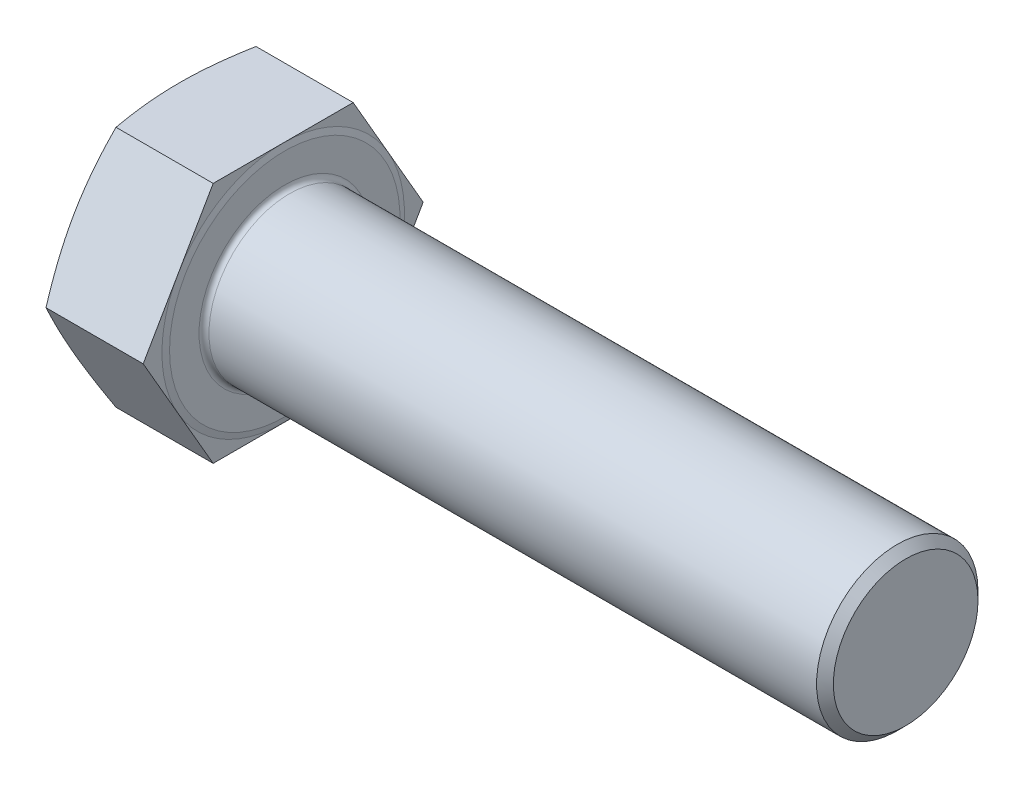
ISO-10303-21;
HEADER;
FILE_DESCRIPTION(('STEP AP214'),'2;1');
FILE_NAME('part.step','',(''),(''),'','','');
FILE_SCHEMA(('AUTOMOTIVE_DESIGN { 1 0 10303 214 1 1 1 1 }'));
ENDSEC;
DATA;
#1=APPLICATION_CONTEXT('core data for automotive mechanical design processes');
#2=APPLICATION_PROTOCOL_DEFINITION('international standard','automotive_design',2000,#1);
#3=PRODUCT_CONTEXT('',#1,'mechanical');
#4=PRODUCT('Part','Part','',(#3));
#5=PRODUCT_RELATED_PRODUCT_CATEGORY('part','',(#4));
#6=PRODUCT_DEFINITION_FORMATION('','',#4);
#7=PRODUCT_DEFINITION_CONTEXT('part definition',#1,'design');
#8=PRODUCT_DEFINITION('design','',#6,#7);
#9=PRODUCT_DEFINITION_SHAPE('','',#8);
#10=(LENGTH_UNIT() NAMED_UNIT(*) SI_UNIT(.MILLI.,.METRE.));
#11=(NAMED_UNIT(*) PLANE_ANGLE_UNIT() SI_UNIT($,.RADIAN.));
#12=(NAMED_UNIT(*) SI_UNIT($,.STERADIAN.) SOLID_ANGLE_UNIT());
#13=UNCERTAINTY_MEASURE_WITH_UNIT(LENGTH_MEASURE(1.E-05),#10,'distance_accuracy_value','');
#14=(GEOMETRIC_REPRESENTATION_CONTEXT(3) GLOBAL_UNCERTAINTY_ASSIGNED_CONTEXT((#13)) GLOBAL_UNIT_ASSIGNED_CONTEXT((#10,
#11,#12)) REPRESENTATION_CONTEXT('',''));
#15=CARTESIAN_POINT('',(0.,0.,0.));
#16=DIRECTION('',(0.,0.,1.));
#17=DIRECTION('',(1.,0.,0.));
#18=AXIS2_PLACEMENT_3D('',#15,#16,#17);
#19=CARTESIAN_POINT('',(34.,0.,0.));
#20=DIRECTION('',(1.,0.,0.));
#21=DIRECTION('',(0.,0.,-1.));
#22=AXIS2_PLACEMENT_3D('',#19,#20,#21);
#23=PLANE('',#22);
#24=CARTESIAN_POINT('',(34.,0.,0.));
#25=DIRECTION('',(1.,0.,0.));
#26=DIRECTION('',(0.,0.,-1.));
#27=AXIS2_PLACEMENT_3D('',#24,#25,#26);
#28=CIRCLE('',#27,27.6);
#29=CARTESIAN_POINT('',(34.,0.,-27.6));
#30=VERTEX_POINT('',#29);
#31=EDGE_CURVE('E188',#30,#30,#28,.F.);
#32=ORIENTED_EDGE('',*,*,#31,.T.);
#33=EDGE_LOOP('',(#32));
#34=FACE_BOUND('',#33,.T.);
#35=CARTESIAN_POINT('',(34.,0.,0.));
#36=DIRECTION('',(-1.,0.,0.));
#37=DIRECTION('',(0.,0.,1.));
#38=AXIS2_PLACEMENT_3D('',#35,#36,#37);
#39=CIRCLE('',#38,37.1);
#40=CARTESIAN_POINT('',(34.,0.,37.1));
#41=VERTEX_POINT('',#40);
#42=EDGE_CURVE('E139',#41,#41,#39,.T.);
#43=ORIENTED_EDGE('',*,*,#42,.F.);
#44=EDGE_LOOP('',(#43));
#45=FACE_BOUND('',#44,.T.);
#46=ADVANCED_FACE('F33',(#34,#45),#23,.T.);
#47=CARTESIAN_POINT('',(33.5,0.,-45.0910560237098));
#48=DIRECTION('',(1.,0.,0.));
#49=DIRECTION('',(0.,0.,-1.));
#50=AXIS2_PLACEMENT_3D('',#47,#48,#49);
#51=PLANE('',#50);
#52=DIRECTION('',(0.,-0.866025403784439,0.5));
#53=VECTOR('',#52,1.);
#54=CARTESIAN_POINT('',(33.5,39.05,22.5455280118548));
#55=LINE('',#54,#53);
#56=CARTESIAN_POINT('',(33.5,39.05,22.5455280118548));
#57=VERTEX_POINT('',#56);
#58=CARTESIAN_POINT('',(33.5,19.525,33.8182920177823));
#59=VERTEX_POINT('',#58);
#60=EDGE_CURVE('E138',#57,#59,#55,.T.);
#61=ORIENTED_EDGE('',*,*,#60,.T.);
#62=CARTESIAN_POINT('',(33.5,0.,0.));
#63=DIRECTION('',(-1.,0.,0.));
#64=DIRECTION('',(0.,0.,1.));
#65=AXIS2_PLACEMENT_3D('',#62,#63,#64);
#66=CIRCLE('',#65,39.05);
#67=CARTESIAN_POINT('',(33.5,39.05,0.));
#68=VERTEX_POINT('',#67);
#69=EDGE_CURVE('E49',#59,#68,#66,.T.);
#70=ORIENTED_EDGE('',*,*,#69,.T.);
#71=DIRECTION('',(0.,0.,1.));
#72=VECTOR('',#71,1.);
#73=CARTESIAN_POINT('',(33.5,39.05,-22.5455280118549));
#74=LINE('',#73,#72);
#75=EDGE_CURVE('E135',#68,#57,#74,.T.);
#76=ORIENTED_EDGE('',*,*,#75,.T.);
#77=EDGE_LOOP('',(#61,#70,#76));
#78=FACE_BOUND('',#77,.T.);
#79=ADVANCED_FACE('F134',(#78),#51,.T.);
#80=CARTESIAN_POINT('',(33.5,39.05,-22.5455280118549));
#81=VERTEX_POINT('',#80);
#82=EDGE_CURVE('E145',#81,#68,#74,.T.);
#83=ORIENTED_EDGE('',*,*,#82,.T.);
#84=CARTESIAN_POINT('',(33.5,19.525,-33.8182920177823));
#85=VERTEX_POINT('',#84);
#86=EDGE_CURVE('E122',#68,#85,#66,.T.);
#87=ORIENTED_EDGE('',*,*,#86,.T.);
#88=DIRECTION('',(0.,0.866025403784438,0.5));
#89=VECTOR('',#88,1.);
#90=CARTESIAN_POINT('',(33.5,0.,-45.0910560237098));
#91=LINE('',#90,#89);
#92=EDGE_CURVE('E151',#85,#81,#91,.T.);
#93=ORIENTED_EDGE('',*,*,#92,.T.);
#94=EDGE_LOOP('',(#83,#87,#93));
#95=FACE_BOUND('',#94,.T.);
#96=ADVANCED_FACE('F150',(#95),#51,.T.);
#97=CARTESIAN_POINT('',(33.5,0.,-45.0910560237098));
#98=VERTEX_POINT('',#97);
#99=EDGE_CURVE('E148',#98,#85,#91,.T.);
#100=ORIENTED_EDGE('',*,*,#99,.T.);
#101=CARTESIAN_POINT('',(33.5,-19.525,-33.8182920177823));
#102=VERTEX_POINT('',#101);
#103=EDGE_CURVE('E125',#85,#102,#66,.T.);
#104=ORIENTED_EDGE('',*,*,#103,.T.);
#105=DIRECTION('',(0.,0.866025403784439,-0.5));
#106=VECTOR('',#105,1.);
#107=CARTESIAN_POINT('',(33.5,-39.05,-22.5455280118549));
#108=LINE('',#107,#106);
#109=EDGE_CURVE('E306',#102,#98,#108,.T.);
#110=ORIENTED_EDGE('',*,*,#109,.T.);
#111=EDGE_LOOP('',(#100,#104,#110));
#112=FACE_BOUND('',#111,.T.);
#113=ADVANCED_FACE('F337',(#112),#51,.T.);
#114=CARTESIAN_POINT('',(33.5,-39.05,-22.5455280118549));
#115=VERTEX_POINT('',#114);
#116=EDGE_CURVE('E304',#115,#102,#108,.T.);
#117=ORIENTED_EDGE('',*,*,#116,.T.);
#118=CARTESIAN_POINT('',(33.5,-39.05,0.));
#119=VERTEX_POINT('',#118);
#120=EDGE_CURVE('E338',#102,#119,#66,.T.);
#121=ORIENTED_EDGE('',*,*,#120,.T.);
#122=DIRECTION('',(0.,0.,-1.));
#123=VECTOR('',#122,1.);
#124=CARTESIAN_POINT('',(33.5,-39.05,22.5455280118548));
#125=LINE('',#124,#123);
#126=EDGE_CURVE('E162',#119,#115,#125,.T.);
#127=ORIENTED_EDGE('',*,*,#126,.T.);
#128=EDGE_LOOP('',(#117,#121,#127));
#129=FACE_BOUND('',#128,.T.);
#130=ADVANCED_FACE('F352',(#129),#51,.T.);
#131=CARTESIAN_POINT('',(33.5,-39.05,22.5455280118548));
#132=VERTEX_POINT('',#131);
#133=EDGE_CURVE('E163',#132,#119,#125,.T.);
#134=ORIENTED_EDGE('',*,*,#133,.T.);
#135=CARTESIAN_POINT('',(33.5,-19.525,33.8182920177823));
#136=VERTEX_POINT('',#135);
#137=EDGE_CURVE('E339',#119,#136,#66,.T.);
#138=ORIENTED_EDGE('',*,*,#137,.T.);
#139=DIRECTION('',(0.,-0.866025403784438,-0.5));
#140=VECTOR('',#139,1.);
#141=CARTESIAN_POINT('',(33.5,0.,45.0910560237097));
#142=LINE('',#141,#140);
#143=EDGE_CURVE('E158',#136,#132,#142,.T.);
#144=ORIENTED_EDGE('',*,*,#143,.T.);
#145=EDGE_LOOP('',(#134,#138,#144));
#146=FACE_BOUND('',#145,.T.);
#147=ADVANCED_FACE('F347',(#146),#51,.T.);
#148=CARTESIAN_POINT('',(33.5,0.,45.0910560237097));
#149=VERTEX_POINT('',#148);
#150=EDGE_CURVE('E159',#149,#136,#142,.T.);
#151=ORIENTED_EDGE('',*,*,#150,.T.);
#152=EDGE_CURVE('E140',#136,#59,#66,.T.);
#153=ORIENTED_EDGE('',*,*,#152,.T.);
#154=EDGE_CURVE('E153',#59,#149,#55,.T.);
#155=ORIENTED_EDGE('',*,*,#154,.T.);
#156=EDGE_LOOP('',(#151,#153,#155));
#157=FACE_BOUND('',#156,.T.);
#158=ADVANCED_FACE('F213',(#157),#51,.T.);
#159=CARTESIAN_POINT('',(33.5,-39.05,-22.5455280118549));
#160=DIRECTION('',(0.,0.5,0.866025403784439));
#161=DIRECTION('',(0.,-0.866025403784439,0.5));
#162=AXIS2_PLACEMENT_3D('',#159,#160,#161);
#163=PLANE('',#162);
#164=CARTESIAN_POINT('',(2.19880660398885,0.000200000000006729,-45.0911714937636));
#165=CARTESIAN_POINT('',(2.02887897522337,-0.808464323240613,-44.6242889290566));
#166=CARTESIAN_POINT('',(1.86659855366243,-1.61836242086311,-44.1566940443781));
#167=CARTESIAN_POINT('',(1.5590027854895,-3.24064593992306,-43.220068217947));
#168=CARTESIAN_POINT('',(1.41368905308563,-4.05303159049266,-42.7510371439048));
#169=CARTESIAN_POINT('',(1.14162647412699,-5.68077724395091,-41.8112577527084));
#170=CARTESIAN_POINT('',(1.01489188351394,-6.49613904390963,-41.3405083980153));
#171=CARTESIAN_POINT('',(0.781802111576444,-8.12903082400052,-40.3977578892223));
#172=CARTESIAN_POINT('',(0.675446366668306,-8.94656074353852,-39.9257567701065));
#173=CARTESIAN_POINT('',(0.485579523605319,-10.5758302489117,-38.9850975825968));
#174=CARTESIAN_POINT('',(0.401862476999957,-11.3875517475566,-38.5164499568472));
#175=CARTESIAN_POINT('',(0.257292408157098,-13.0125329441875,-37.5782666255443));
#176=CARTESIAN_POINT('',(0.196439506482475,-13.8257926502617,-37.1087309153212));
#177=CARTESIAN_POINT('',(0.0986562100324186,-15.4530980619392,-36.1692056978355));
#178=CARTESIAN_POINT('',(0.0617170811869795,-16.2671433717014,-35.6992164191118));
#179=CARTESIAN_POINT('',(0.0123890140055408,-17.8957924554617,-34.7589154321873));
#180=CARTESIAN_POINT('',(0.,-18.7103962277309,-34.2886037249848));
#181=CARTESIAN_POINT('',(0.,-20.3396037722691,-33.3479803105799));
#182=CARTESIAN_POINT('',(0.0123890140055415,-21.1542075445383,-32.8776686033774));
#183=CARTESIAN_POINT('',(0.0617170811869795,-22.7828566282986,-31.9373676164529));
#184=CARTESIAN_POINT('',(0.0986562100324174,-23.5969019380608,-31.4673783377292));
#185=CARTESIAN_POINT('',(0.196439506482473,-25.2242073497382,-30.5278531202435));
#186=CARTESIAN_POINT('',(0.257292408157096,-26.0374670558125,-30.0583174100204));
#187=CARTESIAN_POINT('',(0.401862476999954,-27.6624482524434,-29.1201340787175));
#188=CARTESIAN_POINT('',(0.485579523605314,-28.4741697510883,-28.6514864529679));
#189=CARTESIAN_POINT('',(0.675446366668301,-30.1034392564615,-27.7108272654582));
#190=CARTESIAN_POINT('',(0.78180211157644,-30.9209691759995,-27.2388261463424));
#191=CARTESIAN_POINT('',(1.01489188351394,-32.5538609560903,-26.2960756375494));
#192=CARTESIAN_POINT('',(1.14162647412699,-33.3692227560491,-25.8253262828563));
#193=CARTESIAN_POINT('',(1.41368905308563,-34.9969684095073,-24.8855468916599));
#194=CARTESIAN_POINT('',(1.5590027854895,-35.8093540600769,-24.4165158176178));
#195=CARTESIAN_POINT('',(1.86659855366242,-37.4316375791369,-23.4798899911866));
#196=CARTESIAN_POINT('',(2.02887897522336,-38.2415356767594,-23.0122951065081));
#197=CARTESIAN_POINT('',(2.19880660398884,-39.0502,-22.5454125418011));
#198=B_SPLINE_CURVE_WITH_KNOTS('',3,(#164,#165,#166,#167,#168,#169,#170,#171,#172,#173,#174,
#175,#176,#177,#178,#179,#180,#181,#182,#183,#184,#185,#186,#187,#188,#189,#190,#191,#192,#193,
#194,#195,#196,#197),.UNSPECIFIED.,.F.,.F.,(4,2,2,2,2,2,2,2,2,2,2,2,2,2,2,2,4),(0.,
2.8473194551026,5.69490958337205,8.54467338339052,11.3943583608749,14.2171733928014,
17.040003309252,19.8618016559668,22.6835913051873,25.5053809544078,28.3271793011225,
31.1500092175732,33.9728242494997,36.822509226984,39.6722730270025,42.519863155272,
45.3671826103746),.UNSPECIFIED.);
#199=CARTESIAN_POINT('',(2.19876457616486,0.,-45.0910560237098));
#200=VERTEX_POINT('',#199);
#201=CARTESIAN_POINT('',(0.,-19.525,-33.8182920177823));
#202=VERTEX_POINT('',#201);
#203=EDGE_CURVE('E321',#200,#202,#198,.T.);
#204=ORIENTED_EDGE('',*,*,#203,.F.);
#205=DIRECTION('',(-1.,0.,0.));
#206=VECTOR('',#205,1.);
#207=CARTESIAN_POINT('',(33.5,0.,-45.0910560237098));
#208=LINE('',#207,#206);
#209=EDGE_CURVE('E178',#98,#200,#208,.T.);
#210=ORIENTED_EDGE('',*,*,#209,.F.);
#211=ORIENTED_EDGE('',*,*,#109,.F.);
#212=ORIENTED_EDGE('',*,*,#116,.F.);
#213=DIRECTION('',(-1.,0.,0.));
#214=VECTOR('',#213,1.);
#215=CARTESIAN_POINT('',(33.5,-39.05,-22.5455280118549));
#216=LINE('',#215,#214);
#217=CARTESIAN_POINT('',(2.19876457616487,-39.05,-22.545528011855));
#218=VERTEX_POINT('',#217);
#219=EDGE_CURVE('E166',#115,#218,#216,.T.);
#220=ORIENTED_EDGE('',*,*,#219,.T.);
#221=EDGE_CURVE('E246',#202,#218,#198,.T.);
#222=ORIENTED_EDGE('',*,*,#221,.F.);
#223=EDGE_LOOP('',(#204,#210,#211,#212,#220,#222));
#224=FACE_BOUND('',#223,.T.);
#225=ADVANCED_FACE('F35',(#224),#163,.F.);
#226=CARTESIAN_POINT('',(33.5,0.,-45.0910560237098));
#227=DIRECTION('',(0.,-0.5,0.866025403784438));
#228=DIRECTION('',(0.,-0.866025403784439,-0.5));
#229=AXIS2_PLACEMENT_3D('',#226,#227,#228);
#230=PLANE('',#229);
#231=CARTESIAN_POINT('',(2.19880660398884,39.0502,-22.5454125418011));
#232=CARTESIAN_POINT('',(2.02887897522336,38.2415356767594,-23.0122951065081));
#233=CARTESIAN_POINT('',(1.86659855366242,37.4316375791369,-23.4798899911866));
#234=CARTESIAN_POINT('',(1.5590027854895,35.8093540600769,-24.4165158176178));
#235=CARTESIAN_POINT('',(1.41368905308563,34.9969684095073,-24.8855468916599));
#236=CARTESIAN_POINT('',(1.14162647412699,33.3692227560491,-25.8253262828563));
#237=CARTESIAN_POINT('',(1.01489188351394,32.5538609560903,-26.2960756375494));
#238=CARTESIAN_POINT('',(0.781802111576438,30.9209691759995,-27.2388261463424));
#239=CARTESIAN_POINT('',(0.6754463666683,30.1034392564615,-27.7108272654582));
#240=CARTESIAN_POINT('',(0.485579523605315,28.4741697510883,-28.6514864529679));
#241=CARTESIAN_POINT('',(0.401862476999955,27.6624482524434,-29.1201340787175));
#242=CARTESIAN_POINT('',(0.257292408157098,26.0374670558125,-30.0583174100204));
#243=CARTESIAN_POINT('',(0.196439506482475,25.2242073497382,-30.5278531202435));
#244=CARTESIAN_POINT('',(0.0986562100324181,23.5969019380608,-31.4673783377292));
#245=CARTESIAN_POINT('',(0.061717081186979,22.7828566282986,-31.9373676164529));
#246=CARTESIAN_POINT('',(0.0123890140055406,21.1542075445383,-32.8776686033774));
#247=CARTESIAN_POINT('',(0.,20.3396037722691,-33.3479803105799));
#248=CARTESIAN_POINT('',(0.,18.7103962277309,-34.2886037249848));
#249=CARTESIAN_POINT('',(0.0123890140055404,17.8957924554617,-34.7589154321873));
#250=CARTESIAN_POINT('',(0.0617170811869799,16.2671433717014,-35.6992164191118));
#251=CARTESIAN_POINT('',(0.0986562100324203,15.4530980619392,-36.1692056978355));
#252=CARTESIAN_POINT('',(0.196439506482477,13.8257926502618,-37.1087309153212));
#253=CARTESIAN_POINT('',(0.257292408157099,13.0125329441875,-37.5782666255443));
#254=CARTESIAN_POINT('',(0.401862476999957,11.3875517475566,-38.5164499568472));
#255=CARTESIAN_POINT('',(0.485579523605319,10.5758302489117,-38.9850975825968));
#256=CARTESIAN_POINT('',(0.675446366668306,8.94656074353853,-39.9257567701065));
#257=CARTESIAN_POINT('',(0.781802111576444,8.12903082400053,-40.3977578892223));
#258=CARTESIAN_POINT('',(1.01489188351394,6.49613904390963,-41.3405083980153));
#259=CARTESIAN_POINT('',(1.14162647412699,5.68077724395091,-41.8112577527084));
#260=CARTESIAN_POINT('',(1.41368905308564,4.05303159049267,-42.7510371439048));
#261=CARTESIAN_POINT('',(1.5590027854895,3.24064593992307,-43.220068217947));
#262=CARTESIAN_POINT('',(1.86659855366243,1.61836242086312,-44.1566940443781));
#263=CARTESIAN_POINT('',(2.02887897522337,0.808464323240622,-44.6242889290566));
#264=CARTESIAN_POINT('',(2.19880660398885,-0.000199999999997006,-45.0911714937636));
#265=B_SPLINE_CURVE_WITH_KNOTS('',3,(#231,#232,#233,#234,#235,#236,#237,#238,#239,#240,#241,
#242,#243,#244,#245,#246,#247,#248,#249,#250,#251,#252,#253,#254,#255,#256,#257,#258,#259,#260,
#261,#262,#263,#264),.UNSPECIFIED.,.F.,.F.,(4,2,2,2,2,2,2,2,2,2,2,2,2,2,2,2,4),(0.,
2.8473194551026,5.69490958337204,8.54467338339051,11.3943583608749,14.2171733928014,
17.040003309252,19.8618016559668,22.6835913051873,25.5053809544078,28.3271793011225,
31.1500092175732,33.9728242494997,36.822509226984,39.6722730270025,42.519863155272,
45.3671826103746),.UNSPECIFIED.);
#266=CARTESIAN_POINT('',(2.19876457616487,39.05,-22.545528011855));
#267=VERTEX_POINT('',#266);
#268=CARTESIAN_POINT('',(0.,19.525,-33.8182920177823));
#269=VERTEX_POINT('',#268);
#270=EDGE_CURVE('E261',#267,#269,#265,.T.);
#271=ORIENTED_EDGE('',*,*,#270,.F.);
#272=DIRECTION('',(-1.,0.,0.));
#273=VECTOR('',#272,1.);
#274=CARTESIAN_POINT('',(33.5,39.05,-22.5455280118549));
#275=LINE('',#274,#273);
#276=EDGE_CURVE('E176',#81,#267,#275,.T.);
#277=ORIENTED_EDGE('',*,*,#276,.F.);
#278=ORIENTED_EDGE('',*,*,#92,.F.);
#279=ORIENTED_EDGE('',*,*,#99,.F.);
#280=ORIENTED_EDGE('',*,*,#209,.T.);
#281=EDGE_CURVE('E257',#269,#200,#265,.T.);
#282=ORIENTED_EDGE('',*,*,#281,.F.);
#283=EDGE_LOOP('',(#271,#277,#278,#279,#280,#282));
#284=FACE_BOUND('',#283,.T.);
#285=ADVANCED_FACE('F267',(#284),#230,.F.);
#286=CARTESIAN_POINT('',(33.5,39.05,-22.5455280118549));
#287=DIRECTION('',(0.,-1.,0.));
#288=DIRECTION('',(0.,0.,-1.));
#289=AXIS2_PLACEMENT_3D('',#286,#287,#288);
#290=PLANE('',#289);
#291=CARTESIAN_POINT('',(11.7493259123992,39.05,-59.6926306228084));
#292=CARTESIAN_POINT('',(11.4802734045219,39.05,-58.8092623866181));
#293=CARTESIAN_POINT('',(11.2128440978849,39.05,-57.9253982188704));
#294=CARTESIAN_POINT('',(10.6816039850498,39.05,-56.1565777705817));
#295=CARTESIAN_POINT('',(10.4177931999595,39.05,-55.271621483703));
#296=CARTESIAN_POINT('',(9.89414501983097,39.05,-53.5004580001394));
#297=CARTESIAN_POINT('',(9.63430793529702,39.05,-52.614250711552));
#298=CARTESIAN_POINT('',(9.11906909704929,39.05,-50.8405500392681));
#299=CARTESIAN_POINT('',(8.86366733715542,39.05,-49.9530566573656));
#300=CARTESIAN_POINT('',(8.10388292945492,39.05,-47.2851582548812));
#301=CARTESIAN_POINT('',(7.60690041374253,39.05,-45.5026344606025));
#302=CARTESIAN_POINT('',(6.63738312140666,39.05,-41.9309626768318));
#303=CARTESIAN_POINT('',(6.16484790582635,39.05,-40.1418148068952));
#304=CARTESIAN_POINT('',(5.25593806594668,39.05,-36.5778026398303));
#305=CARTESIAN_POINT('',(4.81918943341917,39.05,-34.8030342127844));
#306=CARTESIAN_POINT('',(3.98287501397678,39.05,-31.2446675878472));
#307=CARTESIAN_POINT('',(3.58330985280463,39.05,-29.4610692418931));
#308=CARTESIAN_POINT('',(2.83067996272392,39.05,-25.8846372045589));
#309=CARTESIAN_POINT('',(2.4775993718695,39.05,-24.0918068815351));
#310=CARTESIAN_POINT('',(1.82868609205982,39.05,-20.4957550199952));
#311=CARTESIAN_POINT('',(1.53285148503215,39.05,-18.6925338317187));
#312=CARTESIAN_POINT('',(1.03975259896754,39.05,-15.2786715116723));
#313=CARTESIAN_POINT('',(0.835155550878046,39.05,-13.6691062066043));
#314=CARTESIAN_POINT('',(0.575376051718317,39.05,-11.2497405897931));
#315=CARTESIAN_POINT('',(0.496634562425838,39.05,-10.4424344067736));
#316=CARTESIAN_POINT('',(0.355742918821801,39.05,-8.82638304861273));
#317=CARTESIAN_POINT('',(0.293592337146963,39.05,-8.01763791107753));
#318=CARTESIAN_POINT('',(0.186685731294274,39.05,-6.39955399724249));
#319=CARTESIAN_POINT('',(0.141917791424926,39.05,-5.59021600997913));
#320=CARTESIAN_POINT('',(0.0702941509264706,39.05,-3.9707445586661));
#321=CARTESIAN_POINT('',(0.0434384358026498,39.05,-3.16061109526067));
#322=CARTESIAN_POINT('',(0.00800035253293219,39.05,-1.53994595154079));
#323=CARTESIAN_POINT('',(-0.000582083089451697,39.05,-0.729414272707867));
#324=CARTESIAN_POINT('',(0.000643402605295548,39.05,0.89163530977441));
#325=CARTESIAN_POINT('',(0.0104513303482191,39.05,1.70215321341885));
#326=CARTESIAN_POINT('',(0.0484197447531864,39.05,3.32686781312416));
#327=CARTESIAN_POINT('',(0.0766729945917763,39.05,4.14106233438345));
#328=CARTESIAN_POINT('',(0.151238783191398,39.05,5.7686200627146));
#329=CARTESIAN_POINT('',(0.197551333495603,39.05,6.58198326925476));
#330=CARTESIAN_POINT('',(0.307633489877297,39.05,8.207525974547));
#331=CARTESIAN_POINT('',(0.371403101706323,39.05,9.01970547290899));
#332=CARTESIAN_POINT('',(0.515609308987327,39.05,10.6425901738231));
#333=CARTESIAN_POINT('',(0.596046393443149,39.05,11.4532953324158));
#334=CARTESIAN_POINT('',(0.86114202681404,39.05,13.8841730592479));
#335=CARTESIAN_POINT('',(1.06949487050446,39.05,15.5018176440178));
#336=CARTESIAN_POINT('',(1.42310454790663,39.05,17.9220965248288));
#337=CARTESIAN_POINT('',(1.54782354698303,39.05,18.7278379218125));
#338=CARTESIAN_POINT('',(1.80988051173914,39.05,20.3372790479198));
#339=CARTESIAN_POINT('',(1.94721856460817,39.05,21.1409787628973));
#340=CARTESIAN_POINT('',(2.39170088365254,39.05,23.6338557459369));
#341=CARTESIAN_POINT('',(2.71869181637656,39.05,25.3195088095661));
#342=CARTESIAN_POINT('',(3.41475154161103,39.05,28.6821282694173));
#343=CARTESIAN_POINT('',(3.78382350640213,39.05,30.3590940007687));
#344=CARTESIAN_POINT('',(4.55630449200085,39.05,33.7055725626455));
#345=CARTESIAN_POINT('',(4.95972348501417,39.05,35.3750830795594));
#346=CARTESIAN_POINT('',(5.79433369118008,39.05,38.7070690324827));
#347=CARTESIAN_POINT('',(6.22552423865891,39.05,40.3695446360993));
#348=CARTESIAN_POINT('',(7.11105522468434,39.05,43.6905844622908));
#349=CARTESIAN_POINT('',(7.56542468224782,39.05,45.3491409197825));
#350=CARTESIAN_POINT('',(8.49264683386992,39.05,48.6610719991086));
#351=CARTESIAN_POINT('',(8.96549960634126,39.05,50.3144465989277));
#352=CARTESIAN_POINT('',(9.92630538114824,39.05,53.6164920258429));
#353=CARTESIAN_POINT('',(10.4142558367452,39.05,55.2651635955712));
#354=CARTESIAN_POINT('',(11.4027093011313,39.05,58.5587293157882));
#355=CARTESIAN_POINT('',(11.9032122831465,39.05,60.2036234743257));
#356=CARTESIAN_POINT('',(12.9090964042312,39.05,63.4720449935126));
#357=CARTESIAN_POINT('',(13.41436267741,39.05,65.0956077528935));
#358=CARTESIAN_POINT('',(14.4335020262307,39.05,68.3400271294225));
#359=CARTESIAN_POINT('',(14.9473751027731,39.05,69.9608837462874));
#360=CARTESIAN_POINT('',(15.9824354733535,39.05,73.2003398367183));
#361=CARTESIAN_POINT('',(16.5036231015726,39.05,74.8189392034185));
#362=CARTESIAN_POINT('',(17.5522174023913,39.05,78.0541225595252));
#363=CARTESIAN_POINT('',(18.079624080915,39.05,79.6707065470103));
#364=CARTESIAN_POINT('',(19.1377632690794,39.05,82.8959891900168));
#365=CARTESIAN_POINT('',(19.668475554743,39.05,84.5046944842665));
#366=CARTESIAN_POINT('',(20.7344797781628,39.05,87.7205873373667));
#367=CARTESIAN_POINT('',(21.2697717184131,39.05,89.3277748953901));
#368=CARTESIAN_POINT('',(22.3442876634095,39.05,92.5406881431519));
#369=CARTESIAN_POINT('',(22.8835113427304,39.05,94.1464139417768));
#370=CARTESIAN_POINT('',(23.9654478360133,39.05,97.3566854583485));
#371=CARTESIAN_POINT('',(24.5081606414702,39.05,98.9612311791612));
#372=CARTESIAN_POINT('',(25.052376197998,39.05,100.565265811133));
#373=B_SPLINE_CURVE_WITH_KNOTS('',3,(#291,#292,#293,#294,#295,#296,#297,#298,#299,#300,#301,
#302,#303,#304,#305,#306,#307,#308,#309,#310,#311,#312,#313,#314,#315,#316,#317,#318,#319,#320,
#321,#322,#323,#324,#325,#326,#327,#328,#329,#330,#331,#332,#333,#334,#335,#336,#337,#338,#339,
#340,#341,#342,#343,#344,#345,#346,#347,#348,#349,#350,#351,#352,#353,#354,#355,#356,#357,#358,
#359,#360,#361,#362,#363,#364,#365,#366,#367,#368,#369,#370,#371,#372),.UNSPECIFIED.,.F.,.F.,(4,
2,2,2,2,2,2,2,2,2,2,2,2,2,2,2,2,2,2,2,2,2,2,2,2,2,2,2,2,2,2,2,2,2,2,2,2,2,2,2,4),(0.,
2.77029982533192,5.54061580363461,8.31114715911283,11.0816746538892,16.6330543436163,
22.1843343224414,27.6671699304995,33.150097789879,38.6311498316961,44.1120181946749,
48.9783767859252,51.4116444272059,53.8448493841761,56.276383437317,58.7079155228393,
61.139438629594,63.5709625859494,66.0148100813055,68.4586591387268,70.9025090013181,
73.3464305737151,78.2381511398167,80.6840912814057,83.1300483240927,88.2805427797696,
93.4314257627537,98.5838093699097,103.736069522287,108.894946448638,114.053845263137,
119.211878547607,124.369900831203,129.470975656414,134.572051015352,139.673360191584,
144.774674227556,149.856624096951,154.938576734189,160.020113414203,165.101637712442),.UNSPECIFIED.);
#374=CARTESIAN_POINT('',(2.19876457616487,39.0500000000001,22.5455280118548));
#375=VERTEX_POINT('',#374);
#376=CARTESIAN_POINT('',(0.,39.05,0.));
#377=VERTEX_POINT('',#376);
#378=EDGE_CURVE('E57',#375,#377,#373,.F.);
#379=ORIENTED_EDGE('',*,*,#378,.F.);
#380=DIRECTION('',(-1.,0.,0.));
#381=VECTOR('',#380,1.);
#382=CARTESIAN_POINT('',(33.5,39.05,22.5455280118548));
#383=LINE('',#382,#381);
#384=EDGE_CURVE('E147',#57,#375,#383,.T.);
#385=ORIENTED_EDGE('',*,*,#384,.F.);
#386=ORIENTED_EDGE('',*,*,#75,.F.);
#387=ORIENTED_EDGE('',*,*,#82,.F.);
#388=ORIENTED_EDGE('',*,*,#276,.T.);
#389=EDGE_CURVE('E262',#377,#267,#373,.F.);
#390=ORIENTED_EDGE('',*,*,#389,.F.);
#391=EDGE_LOOP('',(#379,#385,#386,#387,#388,#390));
#392=FACE_BOUND('',#391,.T.);
#393=ADVANCED_FACE('F143',(#392),#290,.F.);
#394=CARTESIAN_POINT('',(33.5,39.05,22.5455280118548));
#395=DIRECTION('',(0.,-0.5,-0.866025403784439));
#396=DIRECTION('',(0.,0.866025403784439,-0.5));
#397=AXIS2_PLACEMENT_3D('',#394,#395,#396);
#398=PLANE('',#397);
#399=CARTESIAN_POINT('',(2.19880660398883,-0.000200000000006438,45.0911714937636));
#400=CARTESIAN_POINT('',(2.02887897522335,0.808464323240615,44.6242889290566));
#401=CARTESIAN_POINT('',(1.86659855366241,1.61836242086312,44.156694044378));
#402=CARTESIAN_POINT('',(1.55900278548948,3.24064593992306,43.2200682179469));
#403=CARTESIAN_POINT('',(1.41368905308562,4.05303159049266,42.7510371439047));
#404=CARTESIAN_POINT('',(1.14162647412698,5.68077724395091,41.8112577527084));
#405=CARTESIAN_POINT('',(1.01489188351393,6.49613904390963,41.3405083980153));
#406=CARTESIAN_POINT('',(0.781802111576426,8.12903082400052,40.3977578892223));
#407=CARTESIAN_POINT('',(0.675446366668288,8.94656074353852,39.9257567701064));
#408=CARTESIAN_POINT('',(0.485579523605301,10.5758302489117,38.9850975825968));
#409=CARTESIAN_POINT('',(0.401862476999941,11.3875517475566,38.5164499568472));
#410=CARTESIAN_POINT('',(0.257292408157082,13.0125329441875,37.5782666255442));
#411=CARTESIAN_POINT('',(0.196439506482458,13.8257926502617,37.1087309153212));
#412=CARTESIAN_POINT('',(0.0986562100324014,15.4530980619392,36.1692056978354));
#413=CARTESIAN_POINT('',(0.0617170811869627,16.2671433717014,35.6992164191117));
#414=CARTESIAN_POINT('',(0.0123890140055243,17.8957924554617,34.7589154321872));
#415=CARTESIAN_POINT('',(0.,18.7103962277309,34.2886037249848));
#416=CARTESIAN_POINT('',(0.,20.3396037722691,33.3479803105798));
#417=CARTESIAN_POINT('',(0.0123890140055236,21.1542075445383,32.8776686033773));
#418=CARTESIAN_POINT('',(0.0617170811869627,22.7828566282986,31.9373676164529));
#419=CARTESIAN_POINT('',(0.0986562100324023,23.5969019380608,31.4673783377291));
#420=CARTESIAN_POINT('',(0.196439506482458,25.2242073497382,30.5278531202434));
#421=CARTESIAN_POINT('',(0.25729240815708,26.0374670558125,30.0583174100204));
#422=CARTESIAN_POINT('',(0.401862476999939,27.6624482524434,29.1201340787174));
#423=CARTESIAN_POINT('',(0.485579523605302,28.4741697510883,28.6514864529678));
#424=CARTESIAN_POINT('',(0.675446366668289,30.1034392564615,27.7108272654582));
#425=CARTESIAN_POINT('',(0.781802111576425,30.9209691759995,27.2388261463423));
#426=CARTESIAN_POINT('',(1.01489188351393,32.5538609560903,26.2960756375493));
#427=CARTESIAN_POINT('',(1.14162647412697,33.3692227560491,25.8253262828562));
#428=CARTESIAN_POINT('',(1.41368905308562,34.9969684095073,24.8855468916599));
#429=CARTESIAN_POINT('',(1.55900278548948,35.8093540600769,24.4165158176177));
#430=CARTESIAN_POINT('',(1.86659855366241,37.4316375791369,23.4798899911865));
#431=CARTESIAN_POINT('',(2.02887897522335,38.2415356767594,23.012295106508));
#432=CARTESIAN_POINT('',(2.19880660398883,39.0502,22.545412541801));
#433=B_SPLINE_CURVE_WITH_KNOTS('',3,(#399,#400,#401,#402,#403,#404,#405,#406,#407,#408,#409,
#410,#411,#412,#413,#414,#415,#416,#417,#418,#419,#420,#421,#422,#423,#424,#425,#426,#427,#428,
#429,#430,#431,#432),.UNSPECIFIED.,.F.,.F.,(4,2,2,2,2,2,2,2,2,2,2,2,2,2,2,2,4),(0.,
2.8473194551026,5.69490958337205,8.54467338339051,11.3943583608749,14.2171733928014,
17.040003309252,19.8618016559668,22.6835913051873,25.5053809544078,28.3271793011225,
31.1500092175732,33.9728242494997,36.822509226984,39.6722730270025,42.519863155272,
45.3671826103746),.UNSPECIFIED.);
#434=CARTESIAN_POINT('',(2.19876457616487,1.11022302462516E-13,45.0910560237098));
#435=VERTEX_POINT('',#434);
#436=CARTESIAN_POINT('',(0.,19.525,33.8182920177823));
#437=VERTEX_POINT('',#436);
#438=EDGE_CURVE('E251',#435,#437,#433,.T.);
#439=ORIENTED_EDGE('',*,*,#438,.F.);
#440=DIRECTION('',(-1.,0.,0.));
#441=VECTOR('',#440,1.);
#442=CARTESIAN_POINT('',(33.5,0.,45.0910560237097));
#443=LINE('',#442,#441);
#444=EDGE_CURVE('E172',#149,#435,#443,.T.);
#445=ORIENTED_EDGE('',*,*,#444,.F.);
#446=ORIENTED_EDGE('',*,*,#154,.F.);
#447=ORIENTED_EDGE('',*,*,#60,.F.);
#448=ORIENTED_EDGE('',*,*,#384,.T.);
#449=EDGE_CURVE('E312',#437,#375,#433,.T.);
#450=ORIENTED_EDGE('',*,*,#449,.F.);
#451=EDGE_LOOP('',(#439,#445,#446,#447,#448,#450));
#452=FACE_BOUND('',#451,.T.);
#453=ADVANCED_FACE('F273',(#452),#398,.F.);
#454=CARTESIAN_POINT('',(33.5,0.,45.0910560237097));
#455=DIRECTION('',(0.,0.5,-0.866025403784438));
#456=DIRECTION('',(0.,0.866025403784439,0.5));
#457=AXIS2_PLACEMENT_3D('',#454,#455,#456);
#458=PLANE('',#457);
#459=CARTESIAN_POINT('',(2.19880660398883,-39.0502,22.545412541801));
#460=CARTESIAN_POINT('',(2.02887897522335,-38.2415356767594,23.012295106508));
#461=CARTESIAN_POINT('',(1.86659855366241,-37.4316375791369,23.4798899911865));
#462=CARTESIAN_POINT('',(1.55900278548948,-35.8093540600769,24.4165158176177));
#463=CARTESIAN_POINT('',(1.41368905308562,-34.9969684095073,24.8855468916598));
#464=CARTESIAN_POINT('',(1.14162647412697,-33.3692227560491,25.8253262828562));
#465=CARTESIAN_POINT('',(1.01489188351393,-32.5538609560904,26.2960756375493));
#466=CARTESIAN_POINT('',(0.781802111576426,-30.9209691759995,27.2388261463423));
#467=CARTESIAN_POINT('',(0.675446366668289,-30.1034392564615,27.7108272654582));
#468=CARTESIAN_POINT('',(0.485579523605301,-28.4741697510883,28.6514864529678));
#469=CARTESIAN_POINT('',(0.40186247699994,-27.6624482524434,29.1201340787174));
#470=CARTESIAN_POINT('',(0.257292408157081,-26.0374670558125,30.0583174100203));
#471=CARTESIAN_POINT('',(0.196439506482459,-25.2242073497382,30.5278531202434));
#472=CARTESIAN_POINT('',(0.0986562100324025,-23.5969019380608,31.4673783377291));
#473=CARTESIAN_POINT('',(0.0617170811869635,-22.7828566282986,31.9373676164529));
#474=CARTESIAN_POINT('',(0.0123890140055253,-21.1542075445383,32.8776686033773));
#475=CARTESIAN_POINT('',(0.,-20.3396037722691,33.3479803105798));
#476=CARTESIAN_POINT('',(0.,-18.7103962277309,34.2886037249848));
#477=CARTESIAN_POINT('',(0.0123890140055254,-17.8957924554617,34.7589154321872));
#478=CARTESIAN_POINT('',(0.0617170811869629,-16.2671433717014,35.6992164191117));
#479=CARTESIAN_POINT('',(0.0986562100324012,-15.4530980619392,36.1692056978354));
#480=CARTESIAN_POINT('',(0.196439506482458,-13.8257926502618,37.1087309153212));
#481=CARTESIAN_POINT('',(0.257292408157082,-13.0125329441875,37.5782666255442));
#482=CARTESIAN_POINT('',(0.40186247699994,-11.3875517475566,38.5164499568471));
#483=CARTESIAN_POINT('',(0.4855795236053,-10.5758302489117,38.9850975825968));
#484=CARTESIAN_POINT('',(0.675446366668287,-8.94656074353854,39.9257567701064));
#485=CARTESIAN_POINT('',(0.781802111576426,-8.12903082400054,40.3977578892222));
#486=CARTESIAN_POINT('',(1.01489188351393,-6.49613904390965,41.3405083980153));
#487=CARTESIAN_POINT('',(1.14162647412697,-5.68077724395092,41.8112577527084));
#488=CARTESIAN_POINT('',(1.41368905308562,-4.05303159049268,42.7510371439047));
#489=CARTESIAN_POINT('',(1.55900278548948,-3.24064593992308,43.2200682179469));
#490=CARTESIAN_POINT('',(1.86659855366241,-1.61836242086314,44.156694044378));
#491=CARTESIAN_POINT('',(2.02887897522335,-0.808464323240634,44.6242889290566));
#492=CARTESIAN_POINT('',(2.19880660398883,0.000199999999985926,45.0911714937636));
#493=B_SPLINE_CURVE_WITH_KNOTS('',3,(#459,#460,#461,#462,#463,#464,#465,#466,#467,#468,#469,
#470,#471,#472,#473,#474,#475,#476,#477,#478,#479,#480,#481,#482,#483,#484,#485,#486,#487,#488,
#489,#490,#491,#492),.UNSPECIFIED.,.F.,.F.,(4,2,2,2,2,2,2,2,2,2,2,2,2,2,2,2,4),(0.,
2.8473194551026,5.69490958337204,8.54467338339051,11.3943583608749,14.2171733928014,
17.040003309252,19.8618016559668,22.6835913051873,25.5053809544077,28.3271793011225,
31.1500092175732,33.9728242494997,36.822509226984,39.6722730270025,42.5198631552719,
45.3671826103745),.UNSPECIFIED.);
#494=CARTESIAN_POINT('',(2.19876457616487,-39.05,22.545528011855));
#495=VERTEX_POINT('',#494);
#496=CARTESIAN_POINT('',(0.,-19.525,33.8182920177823));
#497=VERTEX_POINT('',#496);
#498=EDGE_CURVE('E239',#495,#497,#493,.T.);
#499=ORIENTED_EDGE('',*,*,#498,.F.);
#500=DIRECTION('',(-1.,0.,0.));
#501=VECTOR('',#500,1.);
#502=CARTESIAN_POINT('',(33.5,-39.05,22.5455280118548));
#503=LINE('',#502,#501);
#504=EDGE_CURVE('E169',#132,#495,#503,.T.);
#505=ORIENTED_EDGE('',*,*,#504,.F.);
#506=ORIENTED_EDGE('',*,*,#143,.F.);
#507=ORIENTED_EDGE('',*,*,#150,.F.);
#508=ORIENTED_EDGE('',*,*,#444,.T.);
#509=EDGE_CURVE('E317',#497,#435,#493,.T.);
#510=ORIENTED_EDGE('',*,*,#509,.F.);
#511=EDGE_LOOP('',(#499,#505,#506,#507,#508,#510));
#512=FACE_BOUND('',#511,.T.);
#513=ADVANCED_FACE('F276',(#512),#458,.F.);
#514=CARTESIAN_POINT('',(33.5,-39.05,22.5455280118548));
#515=DIRECTION('',(0.,1.,0.));
#516=DIRECTION('',(0.,0.,1.));
#517=AXIS2_PLACEMENT_3D('',#514,#515,#516);
#518=PLANE('',#517);
#519=CARTESIAN_POINT('',(11.7493259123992,-39.05,-59.6926306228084));
#520=CARTESIAN_POINT('',(11.4802734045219,-39.05,-58.8092623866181));
#521=CARTESIAN_POINT('',(11.2128440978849,-39.05,-57.9253982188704));
#522=CARTESIAN_POINT('',(10.6816039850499,-39.05,-56.1565777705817));
#523=CARTESIAN_POINT('',(10.4177931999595,-39.05,-55.271621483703));
#524=CARTESIAN_POINT('',(9.89414501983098,-39.05,-53.5004580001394));
#525=CARTESIAN_POINT('',(9.63430793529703,-39.05,-52.614250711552));
#526=CARTESIAN_POINT('',(9.11906909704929,-39.05,-50.8405500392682));
#527=CARTESIAN_POINT('',(8.86366733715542,-39.05,-49.9530566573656));
#528=CARTESIAN_POINT('',(8.10388292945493,-39.05,-47.2851582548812));
#529=CARTESIAN_POINT('',(7.60690041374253,-39.05,-45.5026344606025));
#530=CARTESIAN_POINT('',(6.63738312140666,-39.05,-41.9309626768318));
#531=CARTESIAN_POINT('',(6.16484790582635,-39.05,-40.1418148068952));
#532=CARTESIAN_POINT('',(5.25593806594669,-39.05,-36.5778026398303));
#533=CARTESIAN_POINT('',(4.81918943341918,-39.05,-34.8030342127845));
#534=CARTESIAN_POINT('',(3.98287501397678,-39.05,-31.2446675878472));
#535=CARTESIAN_POINT('',(3.58330985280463,-39.05,-29.4610692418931));
#536=CARTESIAN_POINT('',(2.83067996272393,-39.05,-25.8846372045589));
#537=CARTESIAN_POINT('',(2.4775993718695,-39.05,-24.0918068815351));
#538=CARTESIAN_POINT('',(1.82868609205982,-39.05,-20.4957550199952));
#539=CARTESIAN_POINT('',(1.53285148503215,-39.05,-18.6925338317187));
#540=CARTESIAN_POINT('',(1.03975259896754,-39.05,-15.2786715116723));
#541=CARTESIAN_POINT('',(0.835155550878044,-39.05,-13.6691062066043));
#542=CARTESIAN_POINT('',(0.575376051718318,-39.05,-11.2497405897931));
#543=CARTESIAN_POINT('',(0.496634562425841,-39.05,-10.4424344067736));
#544=CARTESIAN_POINT('',(0.355742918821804,-39.05,-8.82638304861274));
#545=CARTESIAN_POINT('',(0.293592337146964,-39.05,-8.01763791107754));
#546=CARTESIAN_POINT('',(0.186685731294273,-39.05,-6.3995539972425));
#547=CARTESIAN_POINT('',(0.141917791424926,-39.05,-5.59021600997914));
#548=CARTESIAN_POINT('',(0.0702941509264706,-39.05,-3.97074455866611));
#549=CARTESIAN_POINT('',(0.0434384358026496,-39.05,-3.16061109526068));
#550=CARTESIAN_POINT('',(0.00800035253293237,-39.05,-1.5399459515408));
#551=CARTESIAN_POINT('',(-0.000582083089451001,-39.05,-0.729414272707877));
#552=CARTESIAN_POINT('',(0.000643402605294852,-39.05,0.891635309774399));
#553=CARTESIAN_POINT('',(0.0104513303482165,-39.05,1.70215321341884));
#554=CARTESIAN_POINT('',(0.048419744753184,-39.05,3.32686781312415));
#555=CARTESIAN_POINT('',(0.0766729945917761,-39.05,4.14106233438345));
#556=CARTESIAN_POINT('',(0.151238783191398,-39.05,5.76862006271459));
#557=CARTESIAN_POINT('',(0.197551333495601,-39.05,6.58198326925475));
#558=CARTESIAN_POINT('',(0.307633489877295,-39.05,8.20752597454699));
#559=CARTESIAN_POINT('',(0.371403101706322,-39.05,9.01970547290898));
#560=CARTESIAN_POINT('',(0.515609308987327,-39.05,10.6425901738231));
#561=CARTESIAN_POINT('',(0.596046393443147,-39.05,11.4532953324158));
#562=CARTESIAN_POINT('',(0.861142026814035,-39.05,13.8841730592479));
#563=CARTESIAN_POINT('',(1.06949487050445,-39.05,15.5018176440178));
#564=CARTESIAN_POINT('',(1.42310454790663,-39.05,17.9220965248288));
#565=CARTESIAN_POINT('',(1.54782354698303,-39.05,18.7278379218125));
#566=CARTESIAN_POINT('',(1.80988051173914,-39.05,20.3372790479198));
#567=CARTESIAN_POINT('',(1.94721856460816,-39.05,21.1409787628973));
#568=CARTESIAN_POINT('',(2.39170088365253,-39.05,23.6338557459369));
#569=CARTESIAN_POINT('',(2.71869181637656,-39.05,25.3195088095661));
#570=CARTESIAN_POINT('',(3.41475154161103,-39.05,28.6821282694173));
#571=CARTESIAN_POINT('',(3.78382350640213,-39.05,30.3590940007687));
#572=CARTESIAN_POINT('',(4.55630449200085,-39.05,33.7055725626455));
#573=CARTESIAN_POINT('',(4.95972348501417,-39.05,35.3750830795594));
#574=CARTESIAN_POINT('',(5.79433369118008,-39.05,38.7070690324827));
#575=CARTESIAN_POINT('',(6.2255242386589,-39.05,40.3695446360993));
#576=CARTESIAN_POINT('',(7.11105522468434,-39.05,43.6905844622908));
#577=CARTESIAN_POINT('',(7.56542468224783,-39.05,45.3491409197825));
#578=CARTESIAN_POINT('',(8.49264683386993,-39.05,48.6610719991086));
#579=CARTESIAN_POINT('',(8.96549960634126,-39.05,50.3144465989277));
#580=CARTESIAN_POINT('',(9.92630538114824,-39.05,53.6164920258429));
#581=CARTESIAN_POINT('',(10.4142558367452,-39.05,55.2651635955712));
#582=CARTESIAN_POINT('',(11.4027093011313,-39.05,58.5587293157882));
#583=CARTESIAN_POINT('',(11.9032122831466,-39.05,60.2036234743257));
#584=CARTESIAN_POINT('',(12.9090964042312,-39.05,63.4720449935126));
#585=CARTESIAN_POINT('',(13.41436267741,-39.05,65.0956077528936));
#586=CARTESIAN_POINT('',(14.4335020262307,-39.05,68.3400271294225));
#587=CARTESIAN_POINT('',(14.9473751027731,-39.05,69.9608837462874));
#588=CARTESIAN_POINT('',(15.9824354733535,-39.05,73.2003398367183));
#589=CARTESIAN_POINT('',(16.5036231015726,-39.05,74.8189392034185));
#590=CARTESIAN_POINT('',(17.5522174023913,-39.05,78.0541225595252));
#591=CARTESIAN_POINT('',(18.079624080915,-39.05,79.6707065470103));
#592=CARTESIAN_POINT('',(19.1377632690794,-39.05,82.8959891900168));
#593=CARTESIAN_POINT('',(19.668475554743,-39.05,84.5046944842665));
#594=CARTESIAN_POINT('',(20.7344797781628,-39.05,87.7205873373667));
#595=CARTESIAN_POINT('',(21.2697717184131,-39.05,89.3277748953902));
#596=CARTESIAN_POINT('',(22.3442876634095,-39.05,92.5406881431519));
#597=CARTESIAN_POINT('',(22.8835113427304,-39.05,94.1464139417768));
#598=CARTESIAN_POINT('',(23.9654478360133,-39.05,97.3566854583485));
#599=CARTESIAN_POINT('',(24.5081606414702,-39.05,98.9612311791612));
#600=CARTESIAN_POINT('',(25.052376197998,-39.05,100.565265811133));
#601=B_SPLINE_CURVE_WITH_KNOTS('',3,(#519,#520,#521,#522,#523,#524,#525,#526,#527,#528,#529,
#530,#531,#532,#533,#534,#535,#536,#537,#538,#539,#540,#541,#542,#543,#544,#545,#546,#547,#548,
#549,#550,#551,#552,#553,#554,#555,#556,#557,#558,#559,#560,#561,#562,#563,#564,#565,#566,#567,
#568,#569,#570,#571,#572,#573,#574,#575,#576,#577,#578,#579,#580,#581,#582,#583,#584,#585,#586,
#587,#588,#589,#590,#591,#592,#593,#594,#595,#596,#597,#598,#599,#600),.UNSPECIFIED.,.F.,.F.,(4,
2,2,2,2,2,2,2,2,2,2,2,2,2,2,2,2,2,2,2,2,2,2,2,2,2,2,2,2,2,2,2,2,2,2,2,2,2,2,2,4),(0.,
2.77029982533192,5.54061580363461,8.31114715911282,11.0816746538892,16.6330543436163,
22.1843343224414,27.6671699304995,33.150097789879,38.6311498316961,44.1120181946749,
48.9783767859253,51.4116444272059,53.8448493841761,56.276383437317,58.7079155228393,
61.139438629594,63.5709625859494,66.0148100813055,68.4586591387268,70.9025090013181,
73.3464305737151,78.2381511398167,80.6840912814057,83.1300483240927,88.2805427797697,
93.4314257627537,98.5838093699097,103.736069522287,108.894946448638,114.053845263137,
119.211878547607,124.369900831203,129.470975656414,134.572051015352,139.673360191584,
144.774674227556,149.856624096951,154.938576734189,160.020113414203,165.101637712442),.UNSPECIFIED.);
#602=CARTESIAN_POINT('',(0.,-39.05,0.));
#603=VERTEX_POINT('',#602);
#604=EDGE_CURVE('E295',#218,#603,#601,.T.);
#605=ORIENTED_EDGE('',*,*,#604,.F.);
#606=ORIENTED_EDGE('',*,*,#219,.F.);
#607=ORIENTED_EDGE('',*,*,#126,.F.);
#608=ORIENTED_EDGE('',*,*,#133,.F.);
#609=ORIENTED_EDGE('',*,*,#504,.T.);
#610=EDGE_CURVE('E229',#603,#495,#601,.T.);
#611=ORIENTED_EDGE('',*,*,#610,.F.);
#612=EDGE_LOOP('',(#605,#606,#607,#608,#609,#611));
#613=FACE_BOUND('',#612,.T.);
#614=ADVANCED_FACE('F280',(#613),#518,.F.);
#615=CARTESIAN_POINT('',(0.,0.,0.));
#616=DIRECTION('',(1.,0.,0.));
#617=DIRECTION('',(0.,0.,-1.));
#618=AXIS2_PLACEMENT_3D('',#615,#616,#617);
#619=CONICAL_SURFACE('',#618,39.05,1.22173047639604);
#620=ORIENTED_EDGE('',*,*,#281,.T.);
#621=ORIENTED_EDGE('',*,*,#203,.T.);
#622=CARTESIAN_POINT('',(0.,0.,0.));
#623=DIRECTION('',(1.,0.,0.));
#624=DIRECTION('',(0.,0.,-1.));
#625=AXIS2_PLACEMENT_3D('',#622,#623,#624);
#626=CIRCLE('',#625,39.05);
#627=EDGE_CURVE('E181',#202,#269,#626,.T.);
#628=ORIENTED_EDGE('',*,*,#627,.T.);
#629=EDGE_LOOP('',(#620,#621,#628));
#630=FACE_BOUND('',#629,.T.);
#631=ADVANCED_FACE('F284',(#630),#619,.T.);
#632=ORIENTED_EDGE('',*,*,#221,.T.);
#633=ORIENTED_EDGE('',*,*,#604,.T.);
#634=EDGE_CURVE('E184',#603,#202,#626,.T.);
#635=ORIENTED_EDGE('',*,*,#634,.T.);
#636=EDGE_LOOP('',(#632,#633,#635));
#637=FACE_BOUND('',#636,.T.);
#638=ADVANCED_FACE('F289',(#637),#619,.T.);
#639=ORIENTED_EDGE('',*,*,#498,.T.);
#640=EDGE_CURVE('E330',#497,#603,#626,.T.);
#641=ORIENTED_EDGE('',*,*,#640,.T.);
#642=ORIENTED_EDGE('',*,*,#610,.T.);
#643=EDGE_LOOP('',(#639,#641,#642));
#644=FACE_BOUND('',#643,.T.);
#645=ADVANCED_FACE('F224',(#644),#619,.T.);
#646=ORIENTED_EDGE('',*,*,#438,.T.);
#647=EDGE_CURVE('E336',#437,#497,#626,.T.);
#648=ORIENTED_EDGE('',*,*,#647,.T.);
#649=ORIENTED_EDGE('',*,*,#509,.T.);
#650=EDGE_LOOP('',(#646,#648,#649));
#651=FACE_BOUND('',#650,.T.);
#652=ADVANCED_FACE('F223',(#651),#619,.T.);
#653=ORIENTED_EDGE('',*,*,#378,.T.);
#654=CARTESIAN_POINT('',(0.,0.,0.));
#655=DIRECTION('',(-1.,0.,0.));
#656=DIRECTION('',(0.,0.,1.));
#657=AXIS2_PLACEMENT_3D('',#654,#655,#656);
#658=CIRCLE('',#657,39.05);
#659=EDGE_CURVE('E335',#437,#377,#658,.T.);
#660=ORIENTED_EDGE('',*,*,#659,.F.);
#661=ORIENTED_EDGE('',*,*,#449,.T.);
#662=EDGE_LOOP('',(#653,#660,#661));
#663=FACE_BOUND('',#662,.T.);
#664=ADVANCED_FACE('F218',(#663),#619,.T.);
#665=ORIENTED_EDGE('',*,*,#389,.T.);
#666=ORIENTED_EDGE('',*,*,#270,.T.);
#667=EDGE_CURVE('E185',#269,#377,#626,.T.);
#668=ORIENTED_EDGE('',*,*,#667,.T.);
#669=EDGE_LOOP('',(#665,#666,#668));
#670=FACE_BOUND('',#669,.T.);
#671=ADVANCED_FACE('F222',(#670),#619,.T.);
#672=CARTESIAN_POINT('',(0.,0.,-45.0910560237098));
#673=DIRECTION('',(1.,0.,0.));
#674=DIRECTION('',(0.,0.,-1.));
#675=AXIS2_PLACEMENT_3D('',#672,#673,#674);
#676=PLANE('',#675);
#677=ORIENTED_EDGE('',*,*,#667,.F.);
#678=ORIENTED_EDGE('',*,*,#627,.F.);
#679=ORIENTED_EDGE('',*,*,#634,.F.);
#680=ORIENTED_EDGE('',*,*,#640,.F.);
#681=ORIENTED_EDGE('',*,*,#647,.F.);
#682=ORIENTED_EDGE('',*,*,#659,.T.);
#683=EDGE_LOOP('',(#677,#678,#679,#680,#681,#682));
#684=FACE_BOUND('',#683,.T.);
#685=ADVANCED_FACE('F225',(#684),#676,.F.);
#686=CARTESIAN_POINT('',(33.5,0.,0.));
#687=DIRECTION('',(-1.,0.,0.));
#688=DIRECTION('',(0.,0.,1.));
#689=AXIS2_PLACEMENT_3D('',#686,#687,#688);
#690=CONICAL_SURFACE('',#689,39.05,1.31979364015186);
#691=ORIENTED_EDGE('',*,*,#42,.T.);
#692=EDGE_LOOP('',(#691));
#693=FACE_BOUND('',#692,.T.);
#694=ORIENTED_EDGE('',*,*,#69,.F.);
#695=ORIENTED_EDGE('',*,*,#152,.F.);
#696=ORIENTED_EDGE('',*,*,#137,.F.);
#697=ORIENTED_EDGE('',*,*,#120,.F.);
#698=ORIENTED_EDGE('',*,*,#103,.F.);
#699=ORIENTED_EDGE('',*,*,#86,.F.);
#700=EDGE_LOOP('',(#694,#695,#696,#697,#698,#699));
#701=FACE_BOUND('',#700,.T.);
#702=ADVANCED_FACE('F123',(#693,#701),#690,.T.);
#703=CARTESIAN_POINT('',(234.,0.,0.));
#704=DIRECTION('',(-1.,0.,0.));
#705=DIRECTION('',(0.,0.,1.));
#706=AXIS2_PLACEMENT_3D('',#703,#704,#705);
#707=CYLINDRICAL_SURFACE('',#706,26.);
#708=CARTESIAN_POINT('',(231.2935,0.,0.));
#709=DIRECTION('',(1.,0.,0.));
#710=DIRECTION('',(0.,0.,-1.));
#711=AXIS2_PLACEMENT_3D('',#708,#709,#710);
#712=CIRCLE('',#711,26.);
#713=CARTESIAN_POINT('',(231.2935,0.,-26.));
#714=VERTEX_POINT('',#713);
#715=EDGE_CURVE('E12',#714,#714,#712,.F.);
#716=ORIENTED_EDGE('',*,*,#715,.T.);
#717=EDGE_LOOP('',(#716));
#718=FACE_BOUND('',#717,.T.);
#719=CARTESIAN_POINT('',(35.6,0.,0.));
#720=DIRECTION('',(1.,0.,0.));
#721=DIRECTION('',(0.,0.,-1.));
#722=AXIS2_PLACEMENT_3D('',#719,#720,#721);
#723=CIRCLE('',#722,26.);
#724=CARTESIAN_POINT('',(35.6,0.,-26.));
#725=VERTEX_POINT('',#724);
#726=EDGE_CURVE('E129',#725,#725,#723,.T.);
#727=ORIENTED_EDGE('',*,*,#726,.T.);
#728=EDGE_LOOP('',(#727));
#729=FACE_BOUND('',#728,.T.);
#730=ADVANCED_FACE('F454',(#718,#729),#707,.T.);
#731=CARTESIAN_POINT('',(234.,0.,0.));
#732=DIRECTION('',(1.,0.,0.));
#733=DIRECTION('',(0.,0.,-1.));
#734=AXIS2_PLACEMENT_3D('',#731,#732,#733);
#735=PLANE('',#734);
#736=CARTESIAN_POINT('',(234.,0.,0.));
#737=DIRECTION('',(1.,0.,0.));
#738=DIRECTION('',(0.,0.,-1.));
#739=AXIS2_PLACEMENT_3D('',#736,#737,#738);
#740=CIRCLE('',#739,23.2935);
#741=CARTESIAN_POINT('',(234.,0.,-23.2935));
#742=VERTEX_POINT('',#741);
#743=EDGE_CURVE('E42',#742,#742,#740,.T.);
#744=ORIENTED_EDGE('',*,*,#743,.T.);
#745=EDGE_LOOP('',(#744));
#746=FACE_BOUND('',#745,.T.);
#747=ADVANCED_FACE('F193',(#746),#735,.T.);
#748=CARTESIAN_POINT('',(35.6,0.,0.));
#749=DIRECTION('',(1.,0.,0.));
#750=DIRECTION('',(0.,0.,-1.));
#751=AXIS2_PLACEMENT_3D('',#748,#749,#750);
#752=TOROIDAL_SURFACE('',#751,27.6,1.6);
#753=ORIENTED_EDGE('',*,*,#31,.F.);
#754=EDGE_LOOP('',(#753));
#755=FACE_BOUND('',#754,.T.);
#756=ORIENTED_EDGE('',*,*,#726,.F.);
#757=EDGE_LOOP('',(#756));
#758=FACE_BOUND('',#757,.T.);
#759=ADVANCED_FACE('F197',(#755,#758),#752,.F.);
#760=CARTESIAN_POINT('',(234.,0.,0.));
#761=DIRECTION('',(-1.,0.,0.));
#762=DIRECTION('',(0.,0.,1.));
#763=AXIS2_PLACEMENT_3D('',#760,#761,#762);
#764=CONICAL_SURFACE('',#763,23.2935,0.785398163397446);
#765=ORIENTED_EDGE('',*,*,#715,.F.);
#766=EDGE_LOOP('',(#765));
#767=FACE_BOUND('',#766,.T.);
#768=ORIENTED_EDGE('',*,*,#743,.F.);
#769=EDGE_LOOP('',(#768));
#770=FACE_BOUND('',#769,.T.);
#771=ADVANCED_FACE('F195',(#767,#770),#764,.T.);
#772=CLOSED_SHELL('',(#46,#79,#96,#113,#130,#147,#158,#225,#285,#393,#453,#513,#614,#631,#638,
#645,#652,#664,#671,#685,#702,#730,#747,#759,#771));
#773=MANIFOLD_SOLID_BREP('B2',#772);
#774=ADVANCED_BREP_SHAPE_REPRESENTATION('',(#18,#773),#14);
#775=SHAPE_DEFINITION_REPRESENTATION(#9,#774);
ENDSEC;
END-ISO-10303-21;
